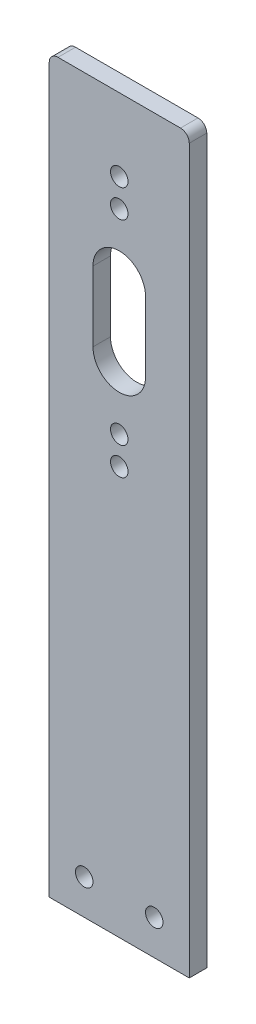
ISO-10303-21;
HEADER;
FILE_DESCRIPTION(('STEP AP214'),'2;1');
FILE_NAME('part.step','',(''),(''),'','','');
FILE_SCHEMA(('AUTOMOTIVE_DESIGN { 1 0 10303 214 1 1 1 1 }'));
ENDSEC;
DATA;
#1=APPLICATION_CONTEXT('core data for automotive mechanical design processes');
#2=APPLICATION_PROTOCOL_DEFINITION('international standard','automotive_design',2000,#1);
#3=PRODUCT_CONTEXT('',#1,'mechanical');
#4=PRODUCT('Part','Part','',(#3));
#5=PRODUCT_RELATED_PRODUCT_CATEGORY('part','',(#4));
#6=PRODUCT_DEFINITION_FORMATION('','',#4);
#7=PRODUCT_DEFINITION_CONTEXT('part definition',#1,'design');
#8=PRODUCT_DEFINITION('design','',#6,#7);
#9=PRODUCT_DEFINITION_SHAPE('','',#8);
#10=(LENGTH_UNIT() NAMED_UNIT(*) SI_UNIT(.MILLI.,.METRE.));
#11=(NAMED_UNIT(*) PLANE_ANGLE_UNIT() SI_UNIT($,.RADIAN.));
#12=(NAMED_UNIT(*) SI_UNIT($,.STERADIAN.) SOLID_ANGLE_UNIT());
#13=UNCERTAINTY_MEASURE_WITH_UNIT(LENGTH_MEASURE(1.E-05),#10,'distance_accuracy_value','');
#14=(GEOMETRIC_REPRESENTATION_CONTEXT(3) GLOBAL_UNCERTAINTY_ASSIGNED_CONTEXT((#13)) GLOBAL_UNIT_ASSIGNED_CONTEXT((#10,
#11,#12)) REPRESENTATION_CONTEXT('',''));
#15=CARTESIAN_POINT('',(0.,0.,0.));
#16=DIRECTION('',(0.,0.,1.));
#17=DIRECTION('',(1.,0.,0.));
#18=AXIS2_PLACEMENT_3D('',#15,#16,#17);
#19=CARTESIAN_POINT('',(-25.4,132.715,3.175));
#20=DIRECTION('',(0.,0.,-1.));
#21=DIRECTION('',(-1.,0.,0.));
#22=AXIS2_PLACEMENT_3D('',#19,#20,#21);
#23=PLANE('',#22);
#24=CARTESIAN_POINT('',(-12.7,-120.015,3.175));
#25=DIRECTION('',(0.,0.,1.));
#26=DIRECTION('',(1.,0.,0.));
#27=AXIS2_PLACEMENT_3D('',#24,#25,#26);
#28=CIRCLE('',#27,3.17499999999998);
#29=CARTESIAN_POINT('',(-9.52500000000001,-120.015,3.175));
#30=VERTEX_POINT('',#29);
#31=EDGE_CURVE('E166',#30,#30,#28,.T.);
#32=ORIENTED_EDGE('',*,*,#31,.F.);
#33=EDGE_LOOP('',(#32));
#34=FACE_BOUND('',#33,.T.);
#35=CARTESIAN_POINT('',(0.,25.4,3.175));
#36=DIRECTION('',(0.,0.,1.));
#37=DIRECTION('',(1.,0.,0.));
#38=AXIS2_PLACEMENT_3D('',#35,#36,#37);
#39=CIRCLE('',#38,3.175);
#40=CARTESIAN_POINT('',(3.175,25.4,3.175));
#41=VERTEX_POINT('',#40);
#42=EDGE_CURVE('E178',#41,#41,#39,.T.);
#43=ORIENTED_EDGE('',*,*,#42,.F.);
#44=EDGE_LOOP('',(#43));
#45=FACE_BOUND('',#44,.T.);
#46=CARTESIAN_POINT('',(0.,96.19742,3.175));
#47=DIRECTION('',(0.,0.,1.));
#48=DIRECTION('',(1.,0.,0.));
#49=AXIS2_PLACEMENT_3D('',#46,#47,#48);
#50=CIRCLE('',#49,3.17499999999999);
#51=CARTESIAN_POINT('',(3.17499999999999,96.19742,3.175));
#52=VERTEX_POINT('',#51);
#53=EDGE_CURVE('E190',#52,#52,#50,.T.);
#54=ORIENTED_EDGE('',*,*,#53,.F.);
#55=EDGE_LOOP('',(#54));
#56=FACE_BOUND('',#55,.T.);
#57=DIRECTION('',(0.,1.,0.));
#58=VECTOR('',#57,1.);
#59=CARTESIAN_POINT('',(25.4,-132.715,3.175));
#60=LINE('',#59,#58);
#61=CARTESIAN_POINT('',(25.4,-132.715,3.175));
#62=VERTEX_POINT('',#61);
#63=CARTESIAN_POINT('',(25.4,129.54,3.175));
#64=VERTEX_POINT('',#63);
#65=EDGE_CURVE('E207',#62,#64,#60,.T.);
#66=ORIENTED_EDGE('',*,*,#65,.T.);
#67=CARTESIAN_POINT('',(22.225,129.54,3.175));
#68=DIRECTION('',(0.,0.,-1.));
#69=DIRECTION('',(-1.,0.,0.));
#70=AXIS2_PLACEMENT_3D('',#67,#68,#69);
#71=CIRCLE('',#70,3.175);
#72=CARTESIAN_POINT('',(22.225,132.715,3.175));
#73=VERTEX_POINT('',#72);
#74=EDGE_CURVE('E52',#64,#73,#71,.F.);
#75=ORIENTED_EDGE('',*,*,#74,.T.);
#76=DIRECTION('',(-1.,0.,0.));
#77=VECTOR('',#76,1.);
#78=CARTESIAN_POINT('',(-25.4,132.715,3.175));
#79=LINE('',#78,#77);
#80=CARTESIAN_POINT('',(-22.225,132.715,3.175));
#81=VERTEX_POINT('',#80);
#82=EDGE_CURVE('E209',#73,#81,#79,.T.);
#83=ORIENTED_EDGE('',*,*,#82,.T.);
#84=CARTESIAN_POINT('',(-22.225,129.54,3.175));
#85=DIRECTION('',(0.,0.,-1.));
#86=DIRECTION('',(-1.,0.,0.));
#87=AXIS2_PLACEMENT_3D('',#84,#85,#86);
#88=CIRCLE('',#87,3.175);
#89=CARTESIAN_POINT('',(-25.4,129.54,3.175));
#90=VERTEX_POINT('',#89);
#91=EDGE_CURVE('E59',#81,#90,#88,.F.);
#92=ORIENTED_EDGE('',*,*,#91,.T.);
#93=DIRECTION('',(0.,-1.,0.));
#94=VECTOR('',#93,1.);
#95=CARTESIAN_POINT('',(-25.4,-132.715,3.175));
#96=LINE('',#95,#94);
#97=CARTESIAN_POINT('',(-25.4,-132.715,3.175));
#98=VERTEX_POINT('',#97);
#99=EDGE_CURVE('E202',#90,#98,#96,.T.);
#100=ORIENTED_EDGE('',*,*,#99,.T.);
#101=DIRECTION('',(1.,0.,0.));
#102=VECTOR('',#101,1.);
#103=CARTESIAN_POINT('',(-25.4,-132.715,3.175));
#104=LINE('',#103,#102);
#105=EDGE_CURVE('E204',#98,#62,#104,.T.);
#106=ORIENTED_EDGE('',*,*,#105,.T.);
#107=EDGE_LOOP('',(#66,#75,#83,#92,#100,#106));
#108=FACE_BOUND('',#107,.T.);
#109=CARTESIAN_POINT('',(0.,106.35742,3.175));
#110=DIRECTION('',(0.,0.,1.));
#111=DIRECTION('',(1.,0.,0.));
#112=AXIS2_PLACEMENT_3D('',#109,#110,#111);
#113=CIRCLE('',#112,3.17499999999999);
#114=CARTESIAN_POINT('',(3.17499999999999,106.35742,3.175));
#115=VERTEX_POINT('',#114);
#116=EDGE_CURVE('E196',#115,#115,#113,.T.);
#117=ORIENTED_EDGE('',*,*,#116,.F.);
#118=EDGE_LOOP('',(#117));
#119=FACE_BOUND('',#118,.T.);
#120=CARTESIAN_POINT('',(0.,15.24,3.175));
#121=DIRECTION('',(0.,0.,1.));
#122=DIRECTION('',(1.,0.,0.));
#123=AXIS2_PLACEMENT_3D('',#120,#121,#122);
#124=CIRCLE('',#123,3.175);
#125=CARTESIAN_POINT('',(3.175,15.24,3.175));
#126=VERTEX_POINT('',#125);
#127=EDGE_CURVE('E184',#126,#126,#124,.T.);
#128=ORIENTED_EDGE('',*,*,#127,.F.);
#129=EDGE_LOOP('',(#128));
#130=FACE_BOUND('',#129,.T.);
#131=CARTESIAN_POINT('',(12.7,-120.015,3.175));
#132=DIRECTION('',(0.,0.,1.));
#133=DIRECTION('',(1.,0.,0.));
#134=AXIS2_PLACEMENT_3D('',#131,#132,#133);
#135=CIRCLE('',#134,3.17499999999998);
#136=CARTESIAN_POINT('',(15.875,-120.015,3.175));
#137=VERTEX_POINT('',#136);
#138=EDGE_CURVE('E172',#137,#137,#135,.T.);
#139=ORIENTED_EDGE('',*,*,#138,.F.);
#140=EDGE_LOOP('',(#139));
#141=FACE_BOUND('',#140,.T.);
#142=CARTESIAN_POINT('',(0.,48.09871,3.175));
#143=DIRECTION('',(0.,0.,1.));
#144=DIRECTION('',(1.,0.,0.));
#145=AXIS2_PLACEMENT_3D('',#142,#143,#144);
#146=CIRCLE('',#145,9.525);
#147=CARTESIAN_POINT('',(-9.525,48.09871,3.175));
#148=VERTEX_POINT('',#147);
#149=CARTESIAN_POINT('',(9.525,48.09871,3.175));
#150=VERTEX_POINT('',#149);
#151=EDGE_CURVE('E125',#148,#150,#146,.T.);
#152=ORIENTED_EDGE('',*,*,#151,.F.);
#153=DIRECTION('',(0.,-1.,0.));
#154=VECTOR('',#153,1.);
#155=CARTESIAN_POINT('',(-9.525,48.09871,3.175));
#156=LINE('',#155,#154);
#157=CARTESIAN_POINT('',(-9.52500000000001,73.49871,3.175));
#158=VERTEX_POINT('',#157);
#159=EDGE_CURVE('E150',#158,#148,#156,.T.);
#160=ORIENTED_EDGE('',*,*,#159,.F.);
#161=CARTESIAN_POINT('',(0.,73.49871,3.175));
#162=DIRECTION('',(0.,0.,1.));
#163=DIRECTION('',(1.,0.,0.));
#164=AXIS2_PLACEMENT_3D('',#161,#162,#163);
#165=CIRCLE('',#164,9.525);
#166=CARTESIAN_POINT('',(9.525,73.49871,3.175));
#167=VERTEX_POINT('',#166);
#168=EDGE_CURVE('E148',#167,#158,#165,.T.);
#169=ORIENTED_EDGE('',*,*,#168,.F.);
#170=DIRECTION('',(0.,1.,0.));
#171=VECTOR('',#170,1.);
#172=CARTESIAN_POINT('',(9.525,73.49871,3.175));
#173=LINE('',#172,#171);
#174=EDGE_CURVE('E135',#150,#167,#173,.T.);
#175=ORIENTED_EDGE('',*,*,#174,.F.);
#176=EDGE_LOOP('',(#152,#160,#169,#175));
#177=FACE_BOUND('',#176,.T.);
#178=ADVANCED_FACE('F44',(#34,#45,#56,#108,#119,#130,#141,#177),#23,.F.);
#179=CARTESIAN_POINT('',(-25.4,132.715,-3.175));
#180=DIRECTION('',(0.,0.,-1.));
#181=DIRECTION('',(-1.,0.,0.));
#182=AXIS2_PLACEMENT_3D('',#179,#180,#181);
#183=PLANE('',#182);
#184=CARTESIAN_POINT('',(-12.7,-120.015,-3.175));
#185=DIRECTION('',(0.,0.,1.));
#186=DIRECTION('',(1.,0.,0.));
#187=AXIS2_PLACEMENT_3D('',#184,#185,#186);
#188=CIRCLE('',#187,3.17499999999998);
#189=CARTESIAN_POINT('',(-9.52500000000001,-120.015,-3.175));
#190=VERTEX_POINT('',#189);
#191=EDGE_CURVE('E143',#190,#190,#188,.T.);
#192=ORIENTED_EDGE('',*,*,#191,.T.);
#193=EDGE_LOOP('',(#192));
#194=FACE_BOUND('',#193,.T.);
#195=CARTESIAN_POINT('',(0.,25.4,-3.175));
#196=DIRECTION('',(0.,0.,1.));
#197=DIRECTION('',(1.,0.,0.));
#198=AXIS2_PLACEMENT_3D('',#195,#196,#197);
#199=CIRCLE('',#198,3.175);
#200=CARTESIAN_POINT('',(3.175,25.4,-3.175));
#201=VERTEX_POINT('',#200);
#202=EDGE_CURVE('E175',#201,#201,#199,.T.);
#203=ORIENTED_EDGE('',*,*,#202,.T.);
#204=EDGE_LOOP('',(#203));
#205=FACE_BOUND('',#204,.T.);
#206=CARTESIAN_POINT('',(0.,96.19742,-3.175));
#207=DIRECTION('',(0.,0.,1.));
#208=DIRECTION('',(1.,0.,0.));
#209=AXIS2_PLACEMENT_3D('',#206,#207,#208);
#210=CIRCLE('',#209,3.17499999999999);
#211=CARTESIAN_POINT('',(3.17499999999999,96.19742,-3.175));
#212=VERTEX_POINT('',#211);
#213=EDGE_CURVE('E187',#212,#212,#210,.T.);
#214=ORIENTED_EDGE('',*,*,#213,.T.);
#215=EDGE_LOOP('',(#214));
#216=FACE_BOUND('',#215,.T.);
#217=DIRECTION('',(-1.,0.,0.));
#218=VECTOR('',#217,1.);
#219=CARTESIAN_POINT('',(-25.4,132.715,-3.175));
#220=LINE('',#219,#218);
#221=CARTESIAN_POINT('',(22.225,132.715,-3.175));
#222=VERTEX_POINT('',#221);
#223=CARTESIAN_POINT('',(-22.225,132.715,-3.175));
#224=VERTEX_POINT('',#223);
#225=EDGE_CURVE('E205',#222,#224,#220,.T.);
#226=ORIENTED_EDGE('',*,*,#225,.F.);
#227=CARTESIAN_POINT('',(22.225,129.54,-3.175));
#228=DIRECTION('',(0.,0.,-1.));
#229=DIRECTION('',(-1.,0.,0.));
#230=AXIS2_PLACEMENT_3D('',#227,#228,#229);
#231=CIRCLE('',#230,3.175);
#232=CARTESIAN_POINT('',(25.4,129.54,-3.175));
#233=VERTEX_POINT('',#232);
#234=EDGE_CURVE('E231',#222,#233,#231,.T.);
#235=ORIENTED_EDGE('',*,*,#234,.T.);
#236=DIRECTION('',(0.,1.,0.));
#237=VECTOR('',#236,1.);
#238=CARTESIAN_POINT('',(25.4,-132.715,-3.175));
#239=LINE('',#238,#237);
#240=CARTESIAN_POINT('',(25.4,-132.715,-3.175));
#241=VERTEX_POINT('',#240);
#242=EDGE_CURVE('E215',#241,#233,#239,.T.);
#243=ORIENTED_EDGE('',*,*,#242,.F.);
#244=DIRECTION('',(1.,0.,0.));
#245=VECTOR('',#244,1.);
#246=CARTESIAN_POINT('',(-25.4,-132.715,-3.175));
#247=LINE('',#246,#245);
#248=CARTESIAN_POINT('',(-25.4,-132.715,-3.175));
#249=VERTEX_POINT('',#248);
#250=EDGE_CURVE('E213',#249,#241,#247,.T.);
#251=ORIENTED_EDGE('',*,*,#250,.F.);
#252=DIRECTION('',(0.,-1.,0.));
#253=VECTOR('',#252,1.);
#254=CARTESIAN_POINT('',(-25.4,-132.715,-3.175));
#255=LINE('',#254,#253);
#256=CARTESIAN_POINT('',(-25.4,129.54,-3.175));
#257=VERTEX_POINT('',#256);
#258=EDGE_CURVE('E199',#257,#249,#255,.T.);
#259=ORIENTED_EDGE('',*,*,#258,.F.);
#260=CARTESIAN_POINT('',(-22.225,129.54,-3.175));
#261=DIRECTION('',(0.,0.,-1.));
#262=DIRECTION('',(-1.,0.,0.));
#263=AXIS2_PLACEMENT_3D('',#260,#261,#262);
#264=CIRCLE('',#263,3.175);
#265=EDGE_CURVE('E229',#257,#224,#264,.T.);
#266=ORIENTED_EDGE('',*,*,#265,.T.);
#267=EDGE_LOOP('',(#226,#235,#243,#251,#259,#266));
#268=FACE_BOUND('',#267,.T.);
#269=CARTESIAN_POINT('',(0.,106.35742,-3.175));
#270=DIRECTION('',(0.,0.,1.));
#271=DIRECTION('',(1.,0.,0.));
#272=AXIS2_PLACEMENT_3D('',#269,#270,#271);
#273=CIRCLE('',#272,3.17499999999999);
#274=CARTESIAN_POINT('',(3.17499999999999,106.35742,-3.175));
#275=VERTEX_POINT('',#274);
#276=EDGE_CURVE('E193',#275,#275,#273,.T.);
#277=ORIENTED_EDGE('',*,*,#276,.T.);
#278=EDGE_LOOP('',(#277));
#279=FACE_BOUND('',#278,.T.);
#280=CARTESIAN_POINT('',(0.,15.24,-3.175));
#281=DIRECTION('',(0.,0.,1.));
#282=DIRECTION('',(1.,0.,0.));
#283=AXIS2_PLACEMENT_3D('',#280,#281,#282);
#284=CIRCLE('',#283,3.175);
#285=CARTESIAN_POINT('',(3.175,15.24,-3.175));
#286=VERTEX_POINT('',#285);
#287=EDGE_CURVE('E181',#286,#286,#284,.T.);
#288=ORIENTED_EDGE('',*,*,#287,.T.);
#289=EDGE_LOOP('',(#288));
#290=FACE_BOUND('',#289,.T.);
#291=CARTESIAN_POINT('',(12.7,-120.015,-3.175));
#292=DIRECTION('',(0.,0.,1.));
#293=DIRECTION('',(1.,0.,0.));
#294=AXIS2_PLACEMENT_3D('',#291,#292,#293);
#295=CIRCLE('',#294,3.17499999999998);
#296=CARTESIAN_POINT('',(15.875,-120.015,-3.175));
#297=VERTEX_POINT('',#296);
#298=EDGE_CURVE('E169',#297,#297,#295,.T.);
#299=ORIENTED_EDGE('',*,*,#298,.T.);
#300=EDGE_LOOP('',(#299));
#301=FACE_BOUND('',#300,.T.);
#302=DIRECTION('',(0.,-1.,0.));
#303=VECTOR('',#302,1.);
#304=CARTESIAN_POINT('',(-9.525,48.09871,-3.175));
#305=LINE('',#304,#303);
#306=CARTESIAN_POINT('',(-9.52500000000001,73.49871,-3.175));
#307=VERTEX_POINT('',#306);
#308=CARTESIAN_POINT('',(-9.525,48.09871,-3.175));
#309=VERTEX_POINT('',#308);
#310=EDGE_CURVE('E136',#307,#309,#305,.T.);
#311=ORIENTED_EDGE('',*,*,#310,.T.);
#312=CARTESIAN_POINT('',(0.,48.09871,-3.175));
#313=DIRECTION('',(0.,0.,1.));
#314=DIRECTION('',(1.,0.,0.));
#315=AXIS2_PLACEMENT_3D('',#312,#313,#314);
#316=CIRCLE('',#315,9.525);
#317=CARTESIAN_POINT('',(9.525,48.09871,-3.175));
#318=VERTEX_POINT('',#317);
#319=EDGE_CURVE('E154',#309,#318,#316,.T.);
#320=ORIENTED_EDGE('',*,*,#319,.T.);
#321=DIRECTION('',(0.,1.,0.));
#322=VECTOR('',#321,1.);
#323=CARTESIAN_POINT('',(9.525,73.49871,-3.175));
#324=LINE('',#323,#322);
#325=CARTESIAN_POINT('',(9.525,73.49871,-3.175));
#326=VERTEX_POINT('',#325);
#327=EDGE_CURVE('E142',#318,#326,#324,.T.);
#328=ORIENTED_EDGE('',*,*,#327,.T.);
#329=CARTESIAN_POINT('',(0.,73.49871,-3.175));
#330=DIRECTION('',(0.,0.,1.));
#331=DIRECTION('',(1.,0.,0.));
#332=AXIS2_PLACEMENT_3D('',#329,#330,#331);
#333=CIRCLE('',#332,9.525);
#334=EDGE_CURVE('E157',#326,#307,#333,.T.);
#335=ORIENTED_EDGE('',*,*,#334,.T.);
#336=EDGE_LOOP('',(#311,#320,#328,#335));
#337=FACE_BOUND('',#336,.T.);
#338=ADVANCED_FACE('F246',(#194,#205,#216,#268,#279,#290,#301,#337),#183,.T.);
#339=CARTESIAN_POINT('',(-25.4,-132.715,3.175));
#340=DIRECTION('',(1.,0.,0.));
#341=DIRECTION('',(0.,0.,-1.));
#342=AXIS2_PLACEMENT_3D('',#339,#340,#341);
#343=PLANE('',#342);
#344=ORIENTED_EDGE('',*,*,#99,.F.);
#345=DIRECTION('',(0.,0.,-1.));
#346=VECTOR('',#345,1.);
#347=CARTESIAN_POINT('',(-25.4,129.54,3.175));
#348=LINE('',#347,#346);
#349=EDGE_CURVE('E13',#90,#257,#348,.T.);
#350=ORIENTED_EDGE('',*,*,#349,.T.);
#351=ORIENTED_EDGE('',*,*,#258,.T.);
#352=DIRECTION('',(0.,0.,-1.));
#353=VECTOR('',#352,1.);
#354=CARTESIAN_POINT('',(-25.4,-132.715,3.175));
#355=LINE('',#354,#353);
#356=EDGE_CURVE('E221',#98,#249,#355,.T.);
#357=ORIENTED_EDGE('',*,*,#356,.F.);
#358=EDGE_LOOP('',(#344,#350,#351,#357));
#359=FACE_BOUND('',#358,.T.);
#360=ADVANCED_FACE('F257',(#359),#343,.F.);
#361=CARTESIAN_POINT('',(-25.4,-132.715,3.175));
#362=DIRECTION('',(0.,1.,0.));
#363=DIRECTION('',(0.,0.,1.));
#364=AXIS2_PLACEMENT_3D('',#361,#362,#363);
#365=PLANE('',#364);
#366=ORIENTED_EDGE('',*,*,#250,.T.);
#367=DIRECTION('',(0.,0.,-1.));
#368=VECTOR('',#367,1.);
#369=CARTESIAN_POINT('',(25.4,-132.715,3.175));
#370=LINE('',#369,#368);
#371=EDGE_CURVE('E211',#62,#241,#370,.T.);
#372=ORIENTED_EDGE('',*,*,#371,.F.);
#373=ORIENTED_EDGE('',*,*,#105,.F.);
#374=ORIENTED_EDGE('',*,*,#356,.T.);
#375=EDGE_LOOP('',(#366,#372,#373,#374));
#376=FACE_BOUND('',#375,.T.);
#377=ADVANCED_FACE('F253',(#376),#365,.F.);
#378=CARTESIAN_POINT('',(25.4,-132.715,3.175));
#379=DIRECTION('',(-1.,0.,0.));
#380=DIRECTION('',(0.,0.,1.));
#381=AXIS2_PLACEMENT_3D('',#378,#379,#380);
#382=PLANE('',#381);
#383=ORIENTED_EDGE('',*,*,#242,.T.);
#384=DIRECTION('',(0.,0.,-1.));
#385=VECTOR('',#384,1.);
#386=CARTESIAN_POINT('',(25.4,129.54,3.175));
#387=LINE('',#386,#385);
#388=EDGE_CURVE('E67',#233,#64,#387,.F.);
#389=ORIENTED_EDGE('',*,*,#388,.T.);
#390=ORIENTED_EDGE('',*,*,#65,.F.);
#391=ORIENTED_EDGE('',*,*,#371,.T.);
#392=EDGE_LOOP('',(#383,#389,#390,#391));
#393=FACE_BOUND('',#392,.T.);
#394=ADVANCED_FACE('F249',(#393),#382,.F.);
#395=CARTESIAN_POINT('',(-25.4,132.715,3.175));
#396=DIRECTION('',(0.,-1.,0.));
#397=DIRECTION('',(0.,0.,-1.));
#398=AXIS2_PLACEMENT_3D('',#395,#396,#397);
#399=PLANE('',#398);
#400=ORIENTED_EDGE('',*,*,#82,.F.);
#401=DIRECTION('',(0.,0.,-1.));
#402=VECTOR('',#401,1.);
#403=CARTESIAN_POINT('',(22.225,132.715,3.175));
#404=LINE('',#403,#402);
#405=EDGE_CURVE('E226',#73,#222,#404,.T.);
#406=ORIENTED_EDGE('',*,*,#405,.T.);
#407=ORIENTED_EDGE('',*,*,#225,.T.);
#408=DIRECTION('',(0.,0.,-1.));
#409=VECTOR('',#408,1.);
#410=CARTESIAN_POINT('',(-22.225,132.715,3.175));
#411=LINE('',#410,#409);
#412=EDGE_CURVE('E224',#224,#81,#411,.F.);
#413=ORIENTED_EDGE('',*,*,#412,.T.);
#414=EDGE_LOOP('',(#400,#406,#407,#413));
#415=FACE_BOUND('',#414,.T.);
#416=ADVANCED_FACE('F240',(#415),#399,.F.);
#417=CARTESIAN_POINT('',(0.,106.35742,3.175));
#418=DIRECTION('',(0.,0.,-1.));
#419=DIRECTION('',(-1.,0.,0.));
#420=AXIS2_PLACEMENT_3D('',#417,#418,#419);
#421=CYLINDRICAL_SURFACE('',#420,3.17499999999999);
#422=ORIENTED_EDGE('',*,*,#116,.T.);
#423=EDGE_LOOP('',(#422));
#424=FACE_BOUND('',#423,.T.);
#425=ORIENTED_EDGE('',*,*,#276,.F.);
#426=EDGE_LOOP('',(#425));
#427=FACE_BOUND('',#426,.T.);
#428=ADVANCED_FACE('F276',(#424,#427),#421,.F.);
#429=CARTESIAN_POINT('',(0.,96.19742,3.175));
#430=DIRECTION('',(0.,0.,-1.));
#431=DIRECTION('',(-1.,0.,0.));
#432=AXIS2_PLACEMENT_3D('',#429,#430,#431);
#433=CYLINDRICAL_SURFACE('',#432,3.17499999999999);
#434=ORIENTED_EDGE('',*,*,#53,.T.);
#435=EDGE_LOOP('',(#434));
#436=FACE_BOUND('',#435,.T.);
#437=ORIENTED_EDGE('',*,*,#213,.F.);
#438=EDGE_LOOP('',(#437));
#439=FACE_BOUND('',#438,.T.);
#440=ADVANCED_FACE('F309',(#436,#439),#433,.F.);
#441=CARTESIAN_POINT('',(0.,15.24,3.175));
#442=DIRECTION('',(0.,0.,-1.));
#443=DIRECTION('',(-1.,0.,0.));
#444=AXIS2_PLACEMENT_3D('',#441,#442,#443);
#445=CYLINDRICAL_SURFACE('',#444,3.175);
#446=ORIENTED_EDGE('',*,*,#127,.T.);
#447=EDGE_LOOP('',(#446));
#448=FACE_BOUND('',#447,.T.);
#449=ORIENTED_EDGE('',*,*,#287,.F.);
#450=EDGE_LOOP('',(#449));
#451=FACE_BOUND('',#450,.T.);
#452=ADVANCED_FACE('F316',(#448,#451),#445,.F.);
#453=CARTESIAN_POINT('',(0.,25.4,3.175));
#454=DIRECTION('',(0.,0.,-1.));
#455=DIRECTION('',(-1.,0.,0.));
#456=AXIS2_PLACEMENT_3D('',#453,#454,#455);
#457=CYLINDRICAL_SURFACE('',#456,3.175);
#458=ORIENTED_EDGE('',*,*,#42,.T.);
#459=EDGE_LOOP('',(#458));
#460=FACE_BOUND('',#459,.T.);
#461=ORIENTED_EDGE('',*,*,#202,.F.);
#462=EDGE_LOOP('',(#461));
#463=FACE_BOUND('',#462,.T.);
#464=ADVANCED_FACE('F323',(#460,#463),#457,.F.);
#465=CARTESIAN_POINT('',(12.7,-120.015,3.175));
#466=DIRECTION('',(0.,0.,-1.));
#467=DIRECTION('',(-1.,0.,0.));
#468=AXIS2_PLACEMENT_3D('',#465,#466,#467);
#469=CYLINDRICAL_SURFACE('',#468,3.17499999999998);
#470=ORIENTED_EDGE('',*,*,#138,.T.);
#471=EDGE_LOOP('',(#470));
#472=FACE_BOUND('',#471,.T.);
#473=ORIENTED_EDGE('',*,*,#298,.F.);
#474=EDGE_LOOP('',(#473));
#475=FACE_BOUND('',#474,.T.);
#476=ADVANCED_FACE('F331',(#472,#475),#469,.F.);
#477=CARTESIAN_POINT('',(-12.7,-120.015,3.175));
#478=DIRECTION('',(0.,0.,-1.));
#479=DIRECTION('',(-1.,0.,0.));
#480=AXIS2_PLACEMENT_3D('',#477,#478,#479);
#481=CYLINDRICAL_SURFACE('',#480,3.17499999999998);
#482=ORIENTED_EDGE('',*,*,#31,.T.);
#483=EDGE_LOOP('',(#482));
#484=FACE_BOUND('',#483,.T.);
#485=ORIENTED_EDGE('',*,*,#191,.F.);
#486=EDGE_LOOP('',(#485));
#487=FACE_BOUND('',#486,.T.);
#488=ADVANCED_FACE('F339',(#484,#487),#481,.F.);
#489=CARTESIAN_POINT('',(0.,48.09871,3.175));
#490=DIRECTION('',(0.,0.,-1.));
#491=DIRECTION('',(-1.,0.,0.));
#492=AXIS2_PLACEMENT_3D('',#489,#490,#491);
#493=CYLINDRICAL_SURFACE('',#492,9.525);
#494=ORIENTED_EDGE('',*,*,#319,.F.);
#495=DIRECTION('',(0.,0.,-1.));
#496=VECTOR('',#495,1.);
#497=CARTESIAN_POINT('',(-9.525,48.09871,3.175));
#498=LINE('',#497,#496);
#499=EDGE_CURVE('E131',#148,#309,#498,.T.);
#500=ORIENTED_EDGE('',*,*,#499,.F.);
#501=ORIENTED_EDGE('',*,*,#151,.T.);
#502=DIRECTION('',(0.,0.,-1.));
#503=VECTOR('',#502,1.);
#504=CARTESIAN_POINT('',(9.525,48.09871,3.175));
#505=LINE('',#504,#503);
#506=EDGE_CURVE('E128',#150,#318,#505,.T.);
#507=ORIENTED_EDGE('',*,*,#506,.T.);
#508=EDGE_LOOP('',(#494,#500,#501,#507));
#509=FACE_BOUND('',#508,.T.);
#510=ADVANCED_FACE('F127',(#509),#493,.F.);
#511=CARTESIAN_POINT('',(9.525,73.49871,3.175));
#512=DIRECTION('',(-1.,0.,0.));
#513=DIRECTION('',(0.,-1.,0.));
#514=AXIS2_PLACEMENT_3D('',#511,#512,#513);
#515=PLANE('',#514);
#516=ORIENTED_EDGE('',*,*,#327,.F.);
#517=ORIENTED_EDGE('',*,*,#506,.F.);
#518=ORIENTED_EDGE('',*,*,#174,.T.);
#519=DIRECTION('',(0.,0.,-1.));
#520=VECTOR('',#519,1.);
#521=CARTESIAN_POINT('',(9.525,73.49871,3.175));
#522=LINE('',#521,#520);
#523=EDGE_CURVE('E144',#167,#326,#522,.T.);
#524=ORIENTED_EDGE('',*,*,#523,.T.);
#525=EDGE_LOOP('',(#516,#517,#518,#524));
#526=FACE_BOUND('',#525,.T.);
#527=ADVANCED_FACE('F139',(#526),#515,.T.);
#528=CARTESIAN_POINT('',(0.,73.49871,3.175));
#529=DIRECTION('',(0.,0.,-1.));
#530=DIRECTION('',(-1.,0.,0.));
#531=AXIS2_PLACEMENT_3D('',#528,#529,#530);
#532=CYLINDRICAL_SURFACE('',#531,9.525);
#533=ORIENTED_EDGE('',*,*,#334,.F.);
#534=ORIENTED_EDGE('',*,*,#523,.F.);
#535=ORIENTED_EDGE('',*,*,#168,.T.);
#536=DIRECTION('',(0.,0.,-1.));
#537=VECTOR('',#536,1.);
#538=CARTESIAN_POINT('',(-9.52500000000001,73.49871,3.175));
#539=LINE('',#538,#537);
#540=EDGE_CURVE('E163',#158,#307,#539,.T.);
#541=ORIENTED_EDGE('',*,*,#540,.T.);
#542=EDGE_LOOP('',(#533,#534,#535,#541));
#543=FACE_BOUND('',#542,.T.);
#544=ADVANCED_FACE('F360',(#543),#532,.F.);
#545=CARTESIAN_POINT('',(-9.525,48.09871,3.175));
#546=DIRECTION('',(1.,0.,0.));
#547=DIRECTION('',(0.,1.,0.));
#548=AXIS2_PLACEMENT_3D('',#545,#546,#547);
#549=PLANE('',#548);
#550=ORIENTED_EDGE('',*,*,#310,.F.);
#551=ORIENTED_EDGE('',*,*,#540,.F.);
#552=ORIENTED_EDGE('',*,*,#159,.T.);
#553=ORIENTED_EDGE('',*,*,#499,.T.);
#554=EDGE_LOOP('',(#550,#551,#552,#553));
#555=FACE_BOUND('',#554,.T.);
#556=ADVANCED_FACE('F264',(#555),#549,.T.);
#557=CARTESIAN_POINT('',(22.225,129.54,3.175));
#558=DIRECTION('',(0.,0.,-1.));
#559=DIRECTION('',(-1.,0.,0.));
#560=AXIS2_PLACEMENT_3D('',#557,#558,#559);
#561=CYLINDRICAL_SURFACE('',#560,3.175);
#562=ORIENTED_EDGE('',*,*,#74,.F.);
#563=ORIENTED_EDGE('',*,*,#388,.F.);
#564=ORIENTED_EDGE('',*,*,#234,.F.);
#565=ORIENTED_EDGE('',*,*,#405,.F.);
#566=EDGE_LOOP('',(#562,#563,#564,#565));
#567=FACE_BOUND('',#566,.T.);
#568=ADVANCED_FACE('F243',(#567),#561,.T.);
#569=CARTESIAN_POINT('',(-22.225,129.54,3.175));
#570=DIRECTION('',(0.,0.,-1.));
#571=DIRECTION('',(-1.,0.,0.));
#572=AXIS2_PLACEMENT_3D('',#569,#570,#571);
#573=CYLINDRICAL_SURFACE('',#572,3.175);
#574=ORIENTED_EDGE('',*,*,#91,.F.);
#575=ORIENTED_EDGE('',*,*,#412,.F.);
#576=ORIENTED_EDGE('',*,*,#265,.F.);
#577=ORIENTED_EDGE('',*,*,#349,.F.);
#578=EDGE_LOOP('',(#574,#575,#576,#577));
#579=FACE_BOUND('',#578,.T.);
#580=ADVANCED_FACE('F46',(#579),#573,.T.);
#581=CLOSED_SHELL('',(#178,#338,#360,#377,#394,#416,#428,#440,#452,#464,#476,#488,#510,#527,
#544,#556,#568,#580));
#582=MANIFOLD_SOLID_BREP('B2',#581);
#583=ADVANCED_BREP_SHAPE_REPRESENTATION('',(#18,#582),#14);
#584=SHAPE_DEFINITION_REPRESENTATION(#9,#583);
ENDSEC;
END-ISO-10303-21;
